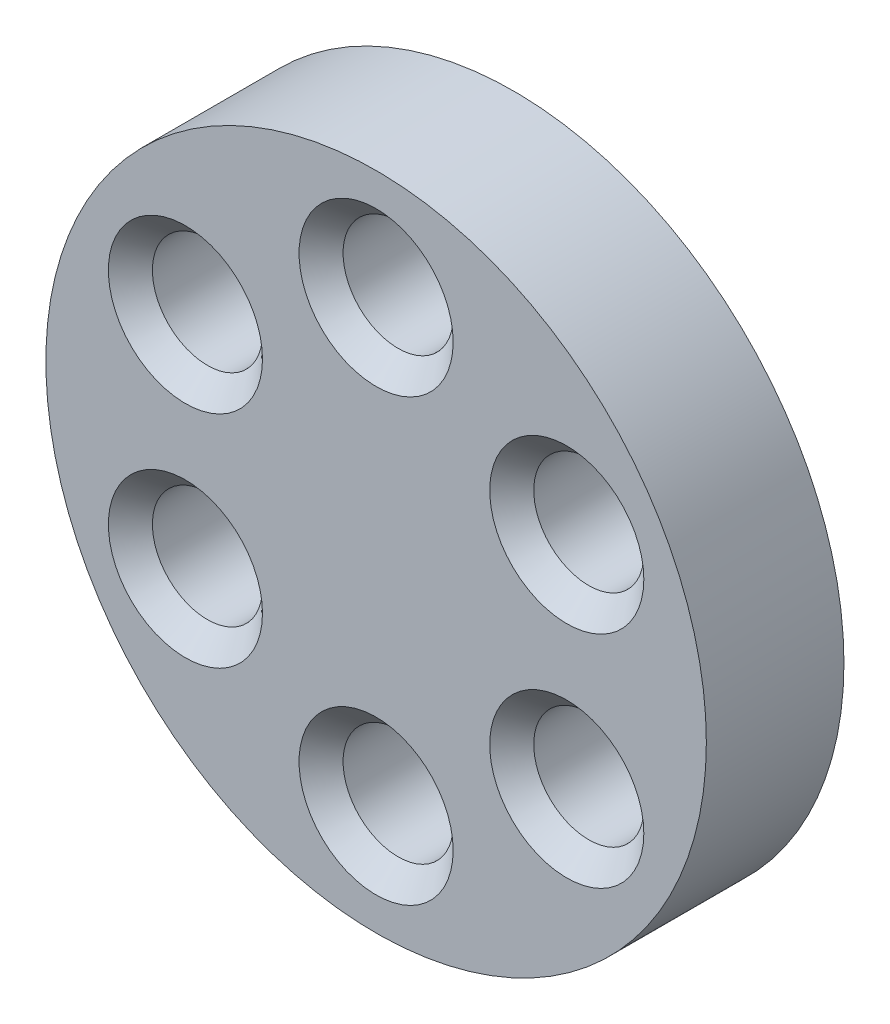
from build123d import *

# Parameters (mm, degrees)
SZKIC1_R                         = 60
DODANIE_WYCI_GNI_CIE1_DEPTH      = 25
SZKIC2_R                         = 10
WYTNIJ_WYCI_GNI_CIE1_DEPTH       = 89.459030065
SFAZOWANIE1_SIZE                 = 4
SZYK_KO_OWY1_COUNT               = 6
SFAZOWANIE1_OF_SZYK_KO_OWY1_SIZE = 4


with BuildPart() as part:
    # Szkic1 → Dodanie-wyci_gni_cie1 (new body)
    with BuildSketch(Plane.XY):
        Circle(SZKIC1_R)
    extrude(amount=DODANIE_WYCI_GNI_CIE1_DEPTH)

    # Szkic2 → Wytnij-wyci_gni_cie1 (cut, through all)
    with BuildSketch(Plane.XY.offset(25)):
        with Locations((0, 40)):
            Circle(SZKIC2_R)
    wytnij_wyci_gni_cie1 = extrude(amount=-WYTNIJ_WYCI_GNI_CIE1_DEPTH, mode=Mode.SUBTRACT)

    # Sfazowanie1
    sfazowanie1_edges = [part.edges().sort_by_distance(p)[0] for p in [
        (-10, 40, 0),
        (-10, 40, 25),
    ]]
    chamfer(sfazowanie1_edges, length=SFAZOWANIE1_SIZE)

    # Szyk ko_owy1: Wytnij-wyci_gni_cie1 ×6 about axis
    szyk_ko_owy1_axis = Axis((0, 0, 0), (0, 0, 1))
    for i in range(1, SZYK_KO_OWY1_COUNT):
        add(wytnij_wyci_gni_cie1.rotate(szyk_ko_owy1_axis, i * 360 / SZYK_KO_OWY1_COUNT), mode=Mode.SUBTRACT)

    # Sfazowanie1 of Szyk ko_owy1
    sfazowanie1_of_szyk_ko_owy1_edges = [part.edges().sort_by_distance(p)[0] for p in [
        (-39.641016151, 11.339745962, 0),
        (-39.641016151, 11.339745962, 25),
        (-29.641016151, -28.660254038, 0),
        (-29.641016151, -28.660254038, 25),
        (10, -40, 0),
        (10, -40, 25),
        (39.641016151, -11.339745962, 0),
        (39.641016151, -11.339745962, 25),
        (29.641016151, 28.660254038, 0),
        (29.641016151, 28.660254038, 25),
    ]]
    chamfer(sfazowanie1_of_szyk_ko_owy1_edges, length=SFAZOWANIE1_OF_SZYK_KO_OWY1_SIZE)


solid = part.part
